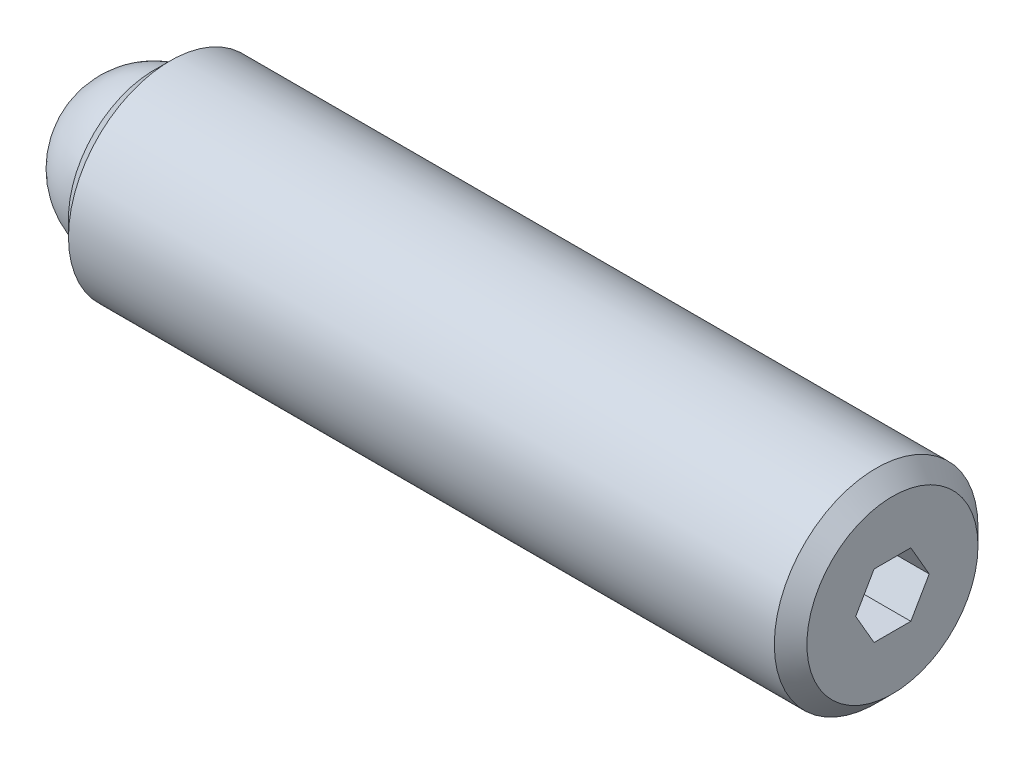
ISO-10303-21;
HEADER;
FILE_DESCRIPTION(('STEP AP214'),'2;1');
FILE_NAME('part.step','',(''),(''),'','','');
FILE_SCHEMA(('AUTOMOTIVE_DESIGN { 1 0 10303 214 1 1 1 1 }'));
ENDSEC;
DATA;
#1=APPLICATION_CONTEXT('core data for automotive mechanical design processes');
#2=APPLICATION_PROTOCOL_DEFINITION('international standard','automotive_design',2000,#1);
#3=PRODUCT_CONTEXT('',#1,'mechanical');
#4=PRODUCT('Part','Part','',(#3));
#5=PRODUCT_RELATED_PRODUCT_CATEGORY('part','',(#4));
#6=PRODUCT_DEFINITION_FORMATION('','',#4);
#7=PRODUCT_DEFINITION_CONTEXT('part definition',#1,'design');
#8=PRODUCT_DEFINITION('design','',#6,#7);
#9=PRODUCT_DEFINITION_SHAPE('','',#8);
#10=(LENGTH_UNIT() NAMED_UNIT(*) SI_UNIT(.MILLI.,.METRE.));
#11=(NAMED_UNIT(*) PLANE_ANGLE_UNIT() SI_UNIT($,.RADIAN.));
#12=(NAMED_UNIT(*) SI_UNIT($,.STERADIAN.) SOLID_ANGLE_UNIT());
#13=UNCERTAINTY_MEASURE_WITH_UNIT(LENGTH_MEASURE(1.E-05),#10,'distance_accuracy_value','');
#14=(GEOMETRIC_REPRESENTATION_CONTEXT(3) GLOBAL_UNCERTAINTY_ASSIGNED_CONTEXT((#13)) GLOBAL_UNIT_ASSIGNED_CONTEXT((#10,
#11,#12)) REPRESENTATION_CONTEXT('',''));
#15=CARTESIAN_POINT('',(0.,0.,0.));
#16=DIRECTION('',(0.,0.,1.));
#17=DIRECTION('',(1.,0.,0.));
#18=AXIS2_PLACEMENT_3D('',#15,#16,#17);
#19=CARTESIAN_POINT('',(0.,0.,0.));
#20=DIRECTION('',(0.,-1.,0.));
#21=DIRECTION('',(0.,0.,1.));
#22=AXIS2_PLACEMENT_3D('',#19,#20,#21);
#23=SPHERICAL_SURFACE('',#22,2.38125);
#24=CARTESIAN_POINT('',(0.,-2.38125,0.));
#25=VERTEX_POINT('',#24);
#26=VERTEX_LOOP('',#25);
#27=FACE_BOUND('',#26,.T.);
#28=ADVANCED_FACE('F41',(#27),#23,.T.);
#29=CLOSED_SHELL('',(#28));
#30=MANIFOLD_SOLID_BREP('B2',#29);
#31=CARTESIAN_POINT('',(23.01875,0.,0.));
#32=DIRECTION('',(-1.,0.,0.));
#33=DIRECTION('',(0.,0.,1.));
#34=AXIS2_PLACEMENT_3D('',#31,#32,#33);
#35=CYLINDRICAL_SURFACE('',#34,3.175);
#36=CARTESIAN_POINT('',(22.51075,0.,0.));
#37=DIRECTION('',(1.,0.,0.));
#38=DIRECTION('',(0.,0.,-1.));
#39=AXIS2_PLACEMENT_3D('',#36,#37,#38);
#40=CIRCLE('',#39,3.175);
#41=CARTESIAN_POINT('',(22.51075,0.,-3.175));
#42=VERTEX_POINT('',#41);
#43=EDGE_CURVE('E39',#42,#42,#40,.F.);
#44=ORIENTED_EDGE('',*,*,#43,.T.);
#45=EDGE_LOOP('',(#44));
#46=FACE_BOUND('',#45,.T.);
#47=CARTESIAN_POINT('',(0.508000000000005,0.,0.));
#48=DIRECTION('',(1.,0.,0.));
#49=DIRECTION('',(0.,0.,-1.));
#50=AXIS2_PLACEMENT_3D('',#47,#48,#49);
#51=CIRCLE('',#50,3.175);
#52=CARTESIAN_POINT('',(0.508000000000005,0.,-3.175));
#53=VERTEX_POINT('',#52);
#54=EDGE_CURVE('E157',#53,#53,#51,.T.);
#55=ORIENTED_EDGE('',*,*,#54,.T.);
#56=EDGE_LOOP('',(#55));
#57=FACE_BOUND('',#56,.T.);
#58=ADVANCED_FACE('F54',(#46,#57),#35,.T.);
#59=CARTESIAN_POINT('',(23.01875,0.,0.));
#60=DIRECTION('',(1.,0.,0.));
#61=DIRECTION('',(0.,0.,-1.));
#62=AXIS2_PLACEMENT_3D('',#59,#60,#61);
#63=PLANE('',#62);
#64=DIRECTION('',(0.,0.866025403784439,-0.5));
#65=VECTOR('',#64,1.);
#66=CARTESIAN_POINT('',(23.01875,-0.9921875,-0.572839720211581));
#67=LINE('',#66,#65);
#68=CARTESIAN_POINT('',(23.01875,-0.9921875,-0.572839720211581));
#69=VERTEX_POINT('',#68);
#70=CARTESIAN_POINT('',(23.01875,0.,-1.14567944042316));
#71=VERTEX_POINT('',#70);
#72=EDGE_CURVE('E69',#69,#71,#67,.T.);
#73=ORIENTED_EDGE('',*,*,#72,.F.);
#74=DIRECTION('',(0.,0.,-1.));
#75=VECTOR('',#74,1.);
#76=CARTESIAN_POINT('',(23.01875,-0.9921875,0.572839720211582));
#77=LINE('',#76,#75);
#78=CARTESIAN_POINT('',(23.01875,-0.9921875,0.572839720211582));
#79=VERTEX_POINT('',#78);
#80=EDGE_CURVE('E153',#79,#69,#77,.T.);
#81=ORIENTED_EDGE('',*,*,#80,.F.);
#82=DIRECTION('',(0.,-0.866025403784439,-0.5));
#83=VECTOR('',#82,1.);
#84=CARTESIAN_POINT('',(23.01875,0.,1.14567944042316));
#85=LINE('',#84,#83);
#86=CARTESIAN_POINT('',(23.01875,0.,1.14567944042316));
#87=VERTEX_POINT('',#86);
#88=EDGE_CURVE('E151',#87,#79,#85,.T.);
#89=ORIENTED_EDGE('',*,*,#88,.F.);
#90=DIRECTION('',(0.,-0.866025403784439,0.5));
#91=VECTOR('',#90,1.);
#92=CARTESIAN_POINT('',(23.01875,0.992187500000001,0.572839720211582));
#93=LINE('',#92,#91);
#94=CARTESIAN_POINT('',(23.01875,0.992187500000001,0.572839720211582));
#95=VERTEX_POINT('',#94);
#96=EDGE_CURVE('E117',#95,#87,#93,.T.);
#97=ORIENTED_EDGE('',*,*,#96,.F.);
#98=DIRECTION('',(0.,0.,1.));
#99=VECTOR('',#98,1.);
#100=CARTESIAN_POINT('',(23.01875,0.9921875,-0.572839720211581));
#101=LINE('',#100,#99);
#102=CARTESIAN_POINT('',(23.01875,0.9921875,-0.572839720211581));
#103=VERTEX_POINT('',#102);
#104=EDGE_CURVE('E147',#103,#95,#101,.T.);
#105=ORIENTED_EDGE('',*,*,#104,.F.);
#106=DIRECTION('',(0.,0.866025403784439,0.5));
#107=VECTOR('',#106,1.);
#108=CARTESIAN_POINT('',(23.01875,0.,-1.14567944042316));
#109=LINE('',#108,#107);
#110=EDGE_CURVE('E143',#71,#103,#109,.T.);
#111=ORIENTED_EDGE('',*,*,#110,.F.);
#112=EDGE_LOOP('',(#73,#81,#89,#97,#105,#111));
#113=FACE_BOUND('',#112,.T.);
#114=CARTESIAN_POINT('',(23.01875,0.,0.));
#115=DIRECTION('',(1.,0.,0.));
#116=DIRECTION('',(0.,0.,-1.));
#117=AXIS2_PLACEMENT_3D('',#114,#115,#116);
#118=CIRCLE('',#117,2.667);
#119=CARTESIAN_POINT('',(23.01875,0.,-2.667));
#120=VERTEX_POINT('',#119);
#121=EDGE_CURVE('E62',#120,#120,#118,.T.);
#122=ORIENTED_EDGE('',*,*,#121,.T.);
#123=EDGE_LOOP('',(#122));
#124=FACE_BOUND('',#123,.T.);
#125=ADVANCED_FACE('F170',(#113,#124),#63,.T.);
#126=CARTESIAN_POINT('',(0.,0.,0.));
#127=DIRECTION('',(1.,0.,0.));
#128=DIRECTION('',(0.,0.,-1.));
#129=AXIS2_PLACEMENT_3D('',#126,#127,#128);
#130=PLANE('',#129);
#131=CARTESIAN_POINT('',(0.,0.,0.));
#132=DIRECTION('',(-1.,0.,0.));
#133=DIRECTION('',(0.,0.,1.));
#134=AXIS2_PLACEMENT_3D('',#131,#132,#133);
#135=CIRCLE('',#134,2.38125);
#136=CARTESIAN_POINT('',(0.,0.,2.38125));
#137=VERTEX_POINT('',#136);
#138=EDGE_CURVE('E225',#137,#137,#135,.T.);
#139=ORIENTED_EDGE('',*,*,#138,.F.);
#140=EDGE_LOOP('',(#139));
#141=FACE_BOUND('',#140,.T.);
#142=CARTESIAN_POINT('',(0.,0.,0.));
#143=DIRECTION('',(1.,0.,0.));
#144=DIRECTION('',(0.,0.,-1.));
#145=AXIS2_PLACEMENT_3D('',#142,#143,#144);
#146=CIRCLE('',#145,2.66699999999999);
#147=CARTESIAN_POINT('',(0.,0.,-2.66699999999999));
#148=VERTEX_POINT('',#147);
#149=EDGE_CURVE('E165',#148,#148,#146,.F.);
#150=ORIENTED_EDGE('',*,*,#149,.T.);
#151=EDGE_LOOP('',(#150));
#152=FACE_BOUND('',#151,.T.);
#153=ADVANCED_FACE('F182',(#141,#152),#130,.F.);
#154=CARTESIAN_POINT('',(0.508000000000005,0.,0.));
#155=DIRECTION('',(1.,0.,0.));
#156=DIRECTION('',(0.,0.,-1.));
#157=AXIS2_PLACEMENT_3D('',#154,#155,#156);
#158=CONICAL_SURFACE('',#157,3.175,0.785398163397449);
#159=ORIENTED_EDGE('',*,*,#149,.F.);
#160=EDGE_LOOP('',(#159));
#161=FACE_BOUND('',#160,.T.);
#162=ORIENTED_EDGE('',*,*,#54,.F.);
#163=EDGE_LOOP('',(#162));
#164=FACE_BOUND('',#163,.T.);
#165=ADVANCED_FACE('F174',(#161,#164),#158,.T.);
#166=CARTESIAN_POINT('',(23.01875,0.,0.));
#167=DIRECTION('',(-1.,0.,0.));
#168=DIRECTION('',(0.,0.,1.));
#169=AXIS2_PLACEMENT_3D('',#166,#167,#168);
#170=CONICAL_SURFACE('',#169,2.667,0.785398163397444);
#171=ORIENTED_EDGE('',*,*,#43,.F.);
#172=EDGE_LOOP('',(#171));
#173=FACE_BOUND('',#172,.T.);
#174=ORIENTED_EDGE('',*,*,#121,.F.);
#175=EDGE_LOOP('',(#174));
#176=FACE_BOUND('',#175,.T.);
#177=ADVANCED_FACE('F56',(#173,#176),#170,.T.);
#178=CARTESIAN_POINT('',(20.73275,-0.9921875,-0.572839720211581));
#179=DIRECTION('',(0.,-0.5,-0.866025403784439));
#180=DIRECTION('',(0.,0.866025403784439,-0.5));
#181=AXIS2_PLACEMENT_3D('',#178,#179,#180);
#182=PLANE('',#181);
#183=ORIENTED_EDGE('',*,*,#72,.T.);
#184=DIRECTION('',(1.,0.,0.));
#185=VECTOR('',#184,1.);
#186=CARTESIAN_POINT('',(20.73275,0.,-1.14567944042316));
#187=LINE('',#186,#185);
#188=CARTESIAN_POINT('',(20.73275,0.,-1.14567944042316));
#189=VERTEX_POINT('',#188);
#190=EDGE_CURVE('E99',#189,#71,#187,.T.);
#191=ORIENTED_EDGE('',*,*,#190,.F.);
#192=DIRECTION('',(0.,0.866025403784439,-0.5));
#193=VECTOR('',#192,1.);
#194=CARTESIAN_POINT('',(20.73275,-0.9921875,-0.572839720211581));
#195=LINE('',#194,#193);
#196=CARTESIAN_POINT('',(20.73275,-0.9921875,-0.572839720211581));
#197=VERTEX_POINT('',#196);
#198=EDGE_CURVE('E155',#197,#189,#195,.T.);
#199=ORIENTED_EDGE('',*,*,#198,.F.);
#200=DIRECTION('',(1.,0.,0.));
#201=VECTOR('',#200,1.);
#202=CARTESIAN_POINT('',(20.73275,-0.9921875,-0.572839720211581));
#203=LINE('',#202,#201);
#204=EDGE_CURVE('E77',#197,#69,#203,.T.);
#205=ORIENTED_EDGE('',*,*,#204,.T.);
#206=EDGE_LOOP('',(#183,#191,#199,#205));
#207=FACE_BOUND('',#206,.T.);
#208=ADVANCED_FACE('F173',(#207),#182,.F.);
#209=CARTESIAN_POINT('',(20.73275,-0.9921875,0.572839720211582));
#210=DIRECTION('',(0.,-1.,0.));
#211=DIRECTION('',(0.,0.,-1.));
#212=AXIS2_PLACEMENT_3D('',#209,#210,#211);
#213=PLANE('',#212);
#214=ORIENTED_EDGE('',*,*,#80,.T.);
#215=ORIENTED_EDGE('',*,*,#204,.F.);
#216=DIRECTION('',(0.,0.,-1.));
#217=VECTOR('',#216,1.);
#218=CARTESIAN_POINT('',(20.73275,-0.9921875,0.572839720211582));
#219=LINE('',#218,#217);
#220=CARTESIAN_POINT('',(20.73275,-0.9921875,0.572839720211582));
#221=VERTEX_POINT('',#220);
#222=EDGE_CURVE('E129',#221,#197,#219,.T.);
#223=ORIENTED_EDGE('',*,*,#222,.F.);
#224=DIRECTION('',(1.,0.,0.));
#225=VECTOR('',#224,1.);
#226=CARTESIAN_POINT('',(20.73275,-0.9921875,0.572839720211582));
#227=LINE('',#226,#225);
#228=EDGE_CURVE('E121',#221,#79,#227,.T.);
#229=ORIENTED_EDGE('',*,*,#228,.T.);
#230=EDGE_LOOP('',(#214,#215,#223,#229));
#231=FACE_BOUND('',#230,.T.);
#232=ADVANCED_FACE('F180',(#231),#213,.F.);
#233=CARTESIAN_POINT('',(20.73275,0.,1.14567944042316));
#234=DIRECTION('',(0.,-0.5,0.866025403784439));
#235=DIRECTION('',(0.,-0.866025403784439,-0.5));
#236=AXIS2_PLACEMENT_3D('',#233,#234,#235);
#237=PLANE('',#236);
#238=ORIENTED_EDGE('',*,*,#88,.T.);
#239=ORIENTED_EDGE('',*,*,#228,.F.);
#240=DIRECTION('',(0.,-0.866025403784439,-0.5));
#241=VECTOR('',#240,1.);
#242=CARTESIAN_POINT('',(20.73275,0.,1.14567944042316));
#243=LINE('',#242,#241);
#244=CARTESIAN_POINT('',(20.73275,0.,1.14567944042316));
#245=VERTEX_POINT('',#244);
#246=EDGE_CURVE('E125',#245,#221,#243,.T.);
#247=ORIENTED_EDGE('',*,*,#246,.F.);
#248=DIRECTION('',(1.,0.,0.));
#249=VECTOR('',#248,1.);
#250=CARTESIAN_POINT('',(20.73275,0.,1.14567944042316));
#251=LINE('',#250,#249);
#252=EDGE_CURVE('E110',#245,#87,#251,.T.);
#253=ORIENTED_EDGE('',*,*,#252,.T.);
#254=EDGE_LOOP('',(#238,#239,#247,#253));
#255=FACE_BOUND('',#254,.T.);
#256=ADVANCED_FACE('F126',(#255),#237,.F.);
#257=CARTESIAN_POINT('',(20.73275,0.992187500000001,0.572839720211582));
#258=DIRECTION('',(0.,0.5,0.866025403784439));
#259=DIRECTION('',(0.,-0.866025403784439,0.5));
#260=AXIS2_PLACEMENT_3D('',#257,#258,#259);
#261=PLANE('',#260);
#262=ORIENTED_EDGE('',*,*,#96,.T.);
#263=ORIENTED_EDGE('',*,*,#252,.F.);
#264=DIRECTION('',(0.,-0.866025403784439,0.5));
#265=VECTOR('',#264,1.);
#266=CARTESIAN_POINT('',(20.73275,0.992187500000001,0.572839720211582));
#267=LINE('',#266,#265);
#268=CARTESIAN_POINT('',(20.73275,0.992187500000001,0.572839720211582));
#269=VERTEX_POINT('',#268);
#270=EDGE_CURVE('E114',#269,#245,#267,.T.);
#271=ORIENTED_EDGE('',*,*,#270,.F.);
#272=DIRECTION('',(1.,0.,0.));
#273=VECTOR('',#272,1.);
#274=CARTESIAN_POINT('',(20.73275,0.992187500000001,0.572839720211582));
#275=LINE('',#274,#273);
#276=EDGE_CURVE('E122',#269,#95,#275,.T.);
#277=ORIENTED_EDGE('',*,*,#276,.T.);
#278=EDGE_LOOP('',(#262,#263,#271,#277));
#279=FACE_BOUND('',#278,.T.);
#280=ADVANCED_FACE('F112',(#279),#261,.F.);
#281=CARTESIAN_POINT('',(20.73275,0.9921875,-0.572839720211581));
#282=DIRECTION('',(0.,1.,0.));
#283=DIRECTION('',(0.,0.,1.));
#284=AXIS2_PLACEMENT_3D('',#281,#282,#283);
#285=PLANE('',#284);
#286=ORIENTED_EDGE('',*,*,#104,.T.);
#287=ORIENTED_EDGE('',*,*,#276,.F.);
#288=DIRECTION('',(0.,0.,1.));
#289=VECTOR('',#288,1.);
#290=CARTESIAN_POINT('',(20.73275,0.9921875,-0.572839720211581));
#291=LINE('',#290,#289);
#292=CARTESIAN_POINT('',(20.73275,0.9921875,-0.572839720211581));
#293=VERTEX_POINT('',#292);
#294=EDGE_CURVE('E135',#293,#269,#291,.T.);
#295=ORIENTED_EDGE('',*,*,#294,.F.);
#296=DIRECTION('',(1.,0.,0.));
#297=VECTOR('',#296,1.);
#298=CARTESIAN_POINT('',(20.73275,0.9921875,-0.572839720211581));
#299=LINE('',#298,#297);
#300=EDGE_CURVE('E160',#293,#103,#299,.T.);
#301=ORIENTED_EDGE('',*,*,#300,.T.);
#302=EDGE_LOOP('',(#286,#287,#295,#301));
#303=FACE_BOUND('',#302,.T.);
#304=ADVANCED_FACE('F201',(#303),#285,.F.);
#305=CARTESIAN_POINT('',(20.73275,0.,-1.14567944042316));
#306=DIRECTION('',(0.,0.5,-0.866025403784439));
#307=DIRECTION('',(0.,0.866025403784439,0.5));
#308=AXIS2_PLACEMENT_3D('',#305,#306,#307);
#309=PLANE('',#308);
#310=ORIENTED_EDGE('',*,*,#110,.T.);
#311=ORIENTED_EDGE('',*,*,#300,.F.);
#312=DIRECTION('',(0.,0.866025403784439,0.5));
#313=VECTOR('',#312,1.);
#314=CARTESIAN_POINT('',(20.73275,0.,-1.14567944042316));
#315=LINE('',#314,#313);
#316=EDGE_CURVE('E137',#189,#293,#315,.T.);
#317=ORIENTED_EDGE('',*,*,#316,.F.);
#318=ORIENTED_EDGE('',*,*,#190,.T.);
#319=EDGE_LOOP('',(#310,#311,#317,#318));
#320=FACE_BOUND('',#319,.T.);
#321=ADVANCED_FACE('F198',(#320),#309,.F.);
#322=CARTESIAN_POINT('',(20.73275,0.,0.));
#323=DIRECTION('',(1.,0.,0.));
#324=DIRECTION('',(0.,0.,-1.));
#325=AXIS2_PLACEMENT_3D('',#322,#323,#324);
#326=PLANE('',#325);
#327=ORIENTED_EDGE('',*,*,#198,.T.);
#328=ORIENTED_EDGE('',*,*,#316,.T.);
#329=ORIENTED_EDGE('',*,*,#294,.T.);
#330=ORIENTED_EDGE('',*,*,#270,.T.);
#331=ORIENTED_EDGE('',*,*,#246,.T.);
#332=ORIENTED_EDGE('',*,*,#222,.T.);
#333=EDGE_LOOP('',(#327,#328,#329,#330,#331,#332));
#334=FACE_BOUND('',#333,.T.);
#335=ADVANCED_FACE('F132',(#334),#326,.T.);
#336=CARTESIAN_POINT('',(1.984375,0.,0.));
#337=DIRECTION('',(-1.,0.,0.));
#338=DIRECTION('',(0.,0.,1.));
#339=AXIS2_PLACEMENT_3D('',#336,#337,#338);
#340=CYLINDRICAL_SURFACE('',#339,2.38125);
#341=CARTESIAN_POINT('',(1.984375,0.,0.));
#342=DIRECTION('',(-1.,0.,0.));
#343=DIRECTION('',(0.,0.,1.));
#344=AXIS2_PLACEMENT_3D('',#341,#342,#343);
#345=CIRCLE('',#344,2.38125);
#346=CARTESIAN_POINT('',(1.984375,0.,2.38125));
#347=VERTEX_POINT('',#346);
#348=EDGE_CURVE('E144',#347,#347,#345,.T.);
#349=ORIENTED_EDGE('',*,*,#348,.F.);
#350=EDGE_LOOP('',(#349));
#351=FACE_BOUND('',#350,.T.);
#352=ORIENTED_EDGE('',*,*,#138,.T.);
#353=EDGE_LOOP('',(#352));
#354=FACE_BOUND('',#353,.T.);
#355=ADVANCED_FACE('F214',(#351,#354),#340,.F.);
#356=CARTESIAN_POINT('',(1.984375,0.,0.));
#357=DIRECTION('',(-1.,0.,0.));
#358=DIRECTION('',(0.,0.,1.));
#359=AXIS2_PLACEMENT_3D('',#356,#357,#358);
#360=PLANE('',#359);
#361=ORIENTED_EDGE('',*,*,#348,.T.);
#362=EDGE_LOOP('',(#361));
#363=FACE_BOUND('',#362,.T.);
#364=ADVANCED_FACE('F217',(#363),#360,.T.);
#365=CLOSED_SHELL('',(#58,#125,#153,#165,#177,#208,#232,#256,#280,#304,#321,#335,#355,#364));
#366=MANIFOLD_SOLID_BREP('B6',#365);
#367=ADVANCED_BREP_SHAPE_REPRESENTATION('',(#18,#30,#366),#14);
#368=SHAPE_DEFINITION_REPRESENTATION(#9,#367);
ENDSEC;
END-ISO-10303-21;
